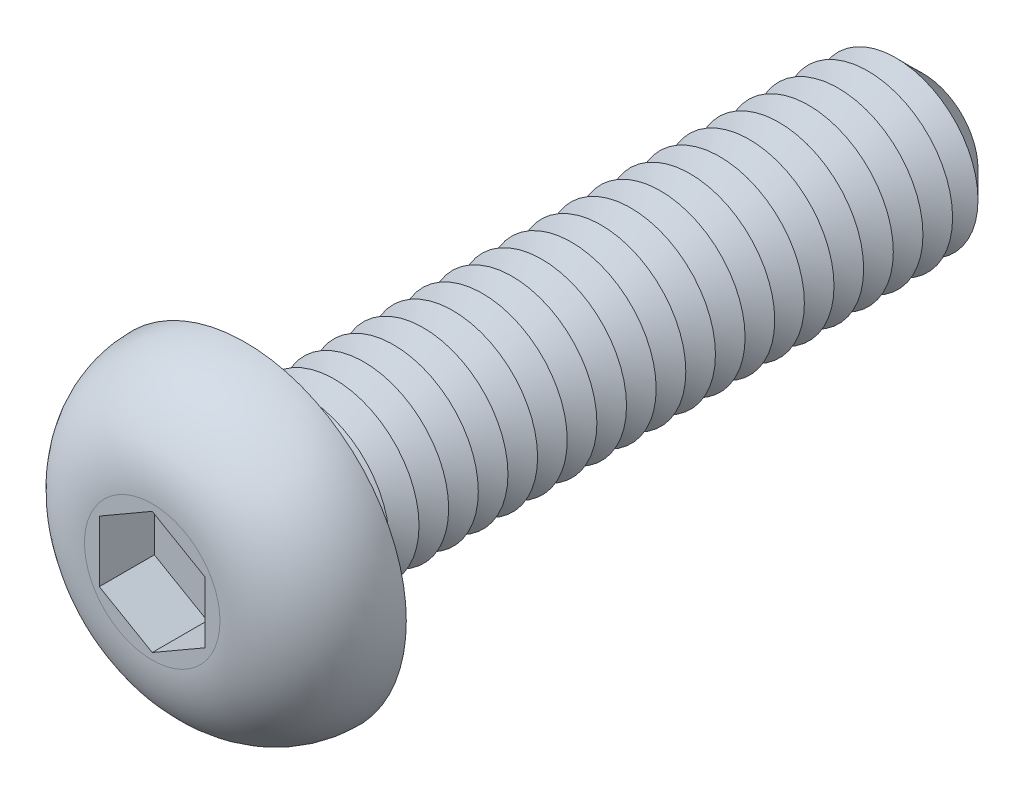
ISO-10303-21;
HEADER;
FILE_DESCRIPTION(('STEP AP214'),'2;1');
FILE_NAME('part.step','',(''),(''),'','','');
FILE_SCHEMA(('AUTOMOTIVE_DESIGN { 1 0 10303 214 1 1 1 1 }'));
ENDSEC;
DATA;
#1=APPLICATION_CONTEXT('core data for automotive mechanical design processes');
#2=APPLICATION_PROTOCOL_DEFINITION('international standard','automotive_design',2000,#1);
#3=PRODUCT_CONTEXT('',#1,'mechanical');
#4=PRODUCT('Part','Part','',(#3));
#5=PRODUCT_RELATED_PRODUCT_CATEGORY('part','',(#4));
#6=PRODUCT_DEFINITION_FORMATION('','',#4);
#7=PRODUCT_DEFINITION_CONTEXT('part definition',#1,'design');
#8=PRODUCT_DEFINITION('design','',#6,#7);
#9=PRODUCT_DEFINITION_SHAPE('','',#8);
#10=(LENGTH_UNIT() NAMED_UNIT(*) SI_UNIT(.MILLI.,.METRE.));
#11=(NAMED_UNIT(*) PLANE_ANGLE_UNIT() SI_UNIT($,.RADIAN.));
#12=(NAMED_UNIT(*) SI_UNIT($,.STERADIAN.) SOLID_ANGLE_UNIT());
#13=UNCERTAINTY_MEASURE_WITH_UNIT(LENGTH_MEASURE(1.E-05),#10,'distance_accuracy_value','');
#14=(GEOMETRIC_REPRESENTATION_CONTEXT(3) GLOBAL_UNCERTAINTY_ASSIGNED_CONTEXT((#13)) GLOBAL_UNIT_ASSIGNED_CONTEXT((#10,
#11,#12)) REPRESENTATION_CONTEXT('',''));
#15=CARTESIAN_POINT('',(0.,0.,0.));
#16=DIRECTION('',(0.,0.,1.));
#17=DIRECTION('',(1.,0.,0.));
#18=AXIS2_PLACEMENT_3D('',#15,#16,#17);
#19=CARTESIAN_POINT('',(0.,0.,-16.));
#20=DIRECTION('',(0.,0.,1.));
#21=DIRECTION('',(1.,0.,0.));
#22=AXIS2_PLACEMENT_3D('',#19,#20,#21);
#23=CYLINDRICAL_SURFACE('',#22,2.);
#24=CARTESIAN_POINT('',(0.,0.,-0.35));
#25=DIRECTION('',(0.,0.,1.));
#26=DIRECTION('',(1.,0.,0.));
#27=AXIS2_PLACEMENT_3D('',#24,#25,#26);
#28=CIRCLE('',#27,2.);
#29=CARTESIAN_POINT('',(2.,0.,-0.35));
#30=VERTEX_POINT('',#29);
#31=EDGE_CURVE('E48',#30,#30,#28,.F.);
#32=ORIENTED_EDGE('',*,*,#31,.T.);
#33=EDGE_LOOP('',(#32));
#34=FACE_BOUND('',#33,.T.);
#35=CARTESIAN_POINT('',(0.,0.,-0.699999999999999));
#36=DIRECTION('',(0.,0.,1.));
#37=DIRECTION('',(1.,0.,0.));
#38=AXIS2_PLACEMENT_3D('',#35,#36,#37);
#39=CIRCLE('',#38,2.);
#40=CARTESIAN_POINT('',(2.,0.,-0.699999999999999));
#41=VERTEX_POINT('',#40);
#42=EDGE_CURVE('E138',#41,#41,#39,.T.);
#43=ORIENTED_EDGE('',*,*,#42,.T.);
#44=EDGE_LOOP('',(#43));
#45=FACE_BOUND('',#44,.T.);
#46=ADVANCED_FACE('F39',(#34,#45),#23,.T.);
#47=CARTESIAN_POINT('',(0.,3.8,0.));
#48=DIRECTION('',(0.,0.,1.));
#49=DIRECTION('',(1.,0.,0.));
#50=AXIS2_PLACEMENT_3D('',#47,#48,#49);
#51=PLANE('',#50);
#52=CARTESIAN_POINT('',(0.,0.,0.));
#53=DIRECTION('',(0.,0.,1.));
#54=DIRECTION('',(1.,0.,0.));
#55=AXIS2_PLACEMENT_3D('',#52,#53,#54);
#56=CIRCLE('',#55,2.35);
#57=CARTESIAN_POINT('',(2.35,0.,0.));
#58=VERTEX_POINT('',#57);
#59=EDGE_CURVE('E11',#58,#58,#56,.T.);
#60=ORIENTED_EDGE('',*,*,#59,.T.);
#61=EDGE_LOOP('',(#60));
#62=FACE_BOUND('',#61,.T.);
#63=CARTESIAN_POINT('',(0.,0.,0.));
#64=DIRECTION('',(0.,0.,1.));
#65=DIRECTION('',(1.,0.,0.));
#66=AXIS2_PLACEMENT_3D('',#63,#64,#65);
#67=CIRCLE('',#66,3.8);
#68=CARTESIAN_POINT('',(3.8,0.,0.));
#69=VERTEX_POINT('',#68);
#70=EDGE_CURVE('E157',#69,#69,#67,.T.);
#71=ORIENTED_EDGE('',*,*,#70,.F.);
#72=EDGE_LOOP('',(#71));
#73=FACE_BOUND('',#72,.T.);
#74=ADVANCED_FACE('F204',(#62,#73),#51,.F.);
#75=CARTESIAN_POINT('',(0.,0.,2.2));
#76=DIRECTION('',(0.,0.,-1.));
#77=DIRECTION('',(-1.,0.,0.));
#78=AXIS2_PLACEMENT_3D('',#75,#76,#77);
#79=PLANE('',#78);
#80=DIRECTION('',(-0.866025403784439,-0.5,0.));
#81=VECTOR('',#80,1.);
#82=CARTESIAN_POINT('',(0.,1.44337567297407,2.2));
#83=LINE('',#82,#81);
#84=CARTESIAN_POINT('',(0.,1.44337567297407,2.2));
#85=VERTEX_POINT('',#84);
#86=CARTESIAN_POINT('',(-1.25,0.721687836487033,2.2));
#87=VERTEX_POINT('',#86);
#88=EDGE_CURVE('E137',#85,#87,#83,.T.);
#89=ORIENTED_EDGE('',*,*,#88,.F.);
#90=DIRECTION('',(-0.866025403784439,0.5,0.));
#91=VECTOR('',#90,1.);
#92=CARTESIAN_POINT('',(1.25,0.721687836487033,2.2));
#93=LINE('',#92,#91);
#94=CARTESIAN_POINT('',(1.25,0.721687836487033,2.2));
#95=VERTEX_POINT('',#94);
#96=EDGE_CURVE('E55',#95,#85,#93,.T.);
#97=ORIENTED_EDGE('',*,*,#96,.F.);
#98=DIRECTION('',(0.,1.,0.));
#99=VECTOR('',#98,1.);
#100=CARTESIAN_POINT('',(1.25,-0.721687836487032,2.2));
#101=LINE('',#100,#99);
#102=CARTESIAN_POINT('',(1.25,-0.721687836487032,2.2));
#103=VERTEX_POINT('',#102);
#104=EDGE_CURVE('E151',#103,#95,#101,.T.);
#105=ORIENTED_EDGE('',*,*,#104,.F.);
#106=DIRECTION('',(0.866025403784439,0.5,0.));
#107=VECTOR('',#106,1.);
#108=CARTESIAN_POINT('',(0.,-1.44337567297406,2.2));
#109=LINE('',#108,#107);
#110=CARTESIAN_POINT('',(0.,-1.44337567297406,2.2));
#111=VERTEX_POINT('',#110);
#112=EDGE_CURVE('E148',#111,#103,#109,.T.);
#113=ORIENTED_EDGE('',*,*,#112,.F.);
#114=DIRECTION('',(0.866025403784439,-0.5,0.));
#115=VECTOR('',#114,1.);
#116=CARTESIAN_POINT('',(-1.25,-0.721687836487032,2.2));
#117=LINE('',#116,#115);
#118=CARTESIAN_POINT('',(-1.25,-0.721687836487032,2.2));
#119=VERTEX_POINT('',#118);
#120=EDGE_CURVE('E103',#119,#111,#117,.T.);
#121=ORIENTED_EDGE('',*,*,#120,.F.);
#122=DIRECTION('',(0.,-1.,0.));
#123=VECTOR('',#122,1.);
#124=CARTESIAN_POINT('',(-1.25,0.721687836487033,2.2));
#125=LINE('',#124,#123);
#126=EDGE_CURVE('E142',#87,#119,#125,.T.);
#127=ORIENTED_EDGE('',*,*,#126,.F.);
#128=EDGE_LOOP('',(#89,#97,#105,#113,#121,#127));
#129=FACE_BOUND('',#128,.T.);
#130=CARTESIAN_POINT('',(0.,0.,2.2));
#131=DIRECTION('',(0.,0.,1.));
#132=DIRECTION('',(1.,0.,0.));
#133=AXIS2_PLACEMENT_3D('',#130,#131,#132);
#134=CIRCLE('',#133,1.6);
#135=CARTESIAN_POINT('',(1.6,0.,2.2));
#136=VERTEX_POINT('',#135);
#137=EDGE_CURVE('E170',#136,#136,#134,.T.);
#138=ORIENTED_EDGE('',*,*,#137,.T.);
#139=EDGE_LOOP('',(#138));
#140=FACE_BOUND('',#139,.T.);
#141=ADVANCED_FACE('F209',(#129,#140),#79,.F.);
#142=CARTESIAN_POINT('',(0.,0.,0.));
#143=DIRECTION('',(0.,0.,1.));
#144=DIRECTION('',(1.,0.,0.));
#145=AXIS2_PLACEMENT_3D('',#142,#143,#144);
#146=DEGENERATE_TOROIDAL_SURFACE('',#145,1.6,2.2,.T.);
#147=ORIENTED_EDGE('',*,*,#137,.F.);
#148=EDGE_LOOP('',(#147));
#149=FACE_BOUND('',#148,.T.);
#150=ORIENTED_EDGE('',*,*,#70,.T.);
#151=EDGE_LOOP('',(#150));
#152=FACE_BOUND('',#151,.T.);
#153=ADVANCED_FACE('F237',(#149,#152),#146,.T.);
#154=CARTESIAN_POINT('',(1.25,0.721687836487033,0.9));
#155=DIRECTION('',(0.5,0.866025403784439,0.));
#156=DIRECTION('',(-0.866025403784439,0.5,0.));
#157=AXIS2_PLACEMENT_3D('',#154,#155,#156);
#158=PLANE('',#157);
#159=ORIENTED_EDGE('',*,*,#96,.T.);
#160=DIRECTION('',(0.,0.,1.));
#161=VECTOR('',#160,1.);
#162=CARTESIAN_POINT('',(0.,1.44337567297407,0.9));
#163=LINE('',#162,#161);
#164=CARTESIAN_POINT('',(0.,1.44337567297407,0.9));
#165=VERTEX_POINT('',#164);
#166=EDGE_CURVE('E85',#165,#85,#163,.T.);
#167=ORIENTED_EDGE('',*,*,#166,.F.);
#168=DIRECTION('',(-0.866025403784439,0.5,0.));
#169=VECTOR('',#168,1.);
#170=CARTESIAN_POINT('',(1.25,0.721687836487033,0.9));
#171=LINE('',#170,#169);
#172=CARTESIAN_POINT('',(1.25,0.721687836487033,0.9));
#173=VERTEX_POINT('',#172);
#174=EDGE_CURVE('E154',#173,#165,#171,.T.);
#175=ORIENTED_EDGE('',*,*,#174,.F.);
#176=DIRECTION('',(0.,0.,1.));
#177=VECTOR('',#176,1.);
#178=CARTESIAN_POINT('',(1.25,0.721687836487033,0.9));
#179=LINE('',#178,#177);
#180=EDGE_CURVE('E63',#173,#95,#179,.T.);
#181=ORIENTED_EDGE('',*,*,#180,.T.);
#182=EDGE_LOOP('',(#159,#167,#175,#181));
#183=FACE_BOUND('',#182,.T.);
#184=ADVANCED_FACE('F223',(#183),#158,.F.);
#185=CARTESIAN_POINT('',(1.25,-0.721687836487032,0.9));
#186=DIRECTION('',(1.,0.,0.));
#187=DIRECTION('',(0.,1.,0.));
#188=AXIS2_PLACEMENT_3D('',#185,#186,#187);
#189=PLANE('',#188);
#190=ORIENTED_EDGE('',*,*,#104,.T.);
#191=ORIENTED_EDGE('',*,*,#180,.F.);
#192=DIRECTION('',(0.,1.,0.));
#193=VECTOR('',#192,1.);
#194=CARTESIAN_POINT('',(1.25,-0.721687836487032,0.9));
#195=LINE('',#194,#193);
#196=CARTESIAN_POINT('',(1.25,-0.721687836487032,0.9));
#197=VERTEX_POINT('',#196);
#198=EDGE_CURVE('E117',#197,#173,#195,.T.);
#199=ORIENTED_EDGE('',*,*,#198,.F.);
#200=DIRECTION('',(0.,0.,1.));
#201=VECTOR('',#200,1.);
#202=CARTESIAN_POINT('',(1.25,-0.721687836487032,0.9));
#203=LINE('',#202,#201);
#204=EDGE_CURVE('E108',#197,#103,#203,.T.);
#205=ORIENTED_EDGE('',*,*,#204,.T.);
#206=EDGE_LOOP('',(#190,#191,#199,#205));
#207=FACE_BOUND('',#206,.T.);
#208=ADVANCED_FACE('F220',(#207),#189,.F.);
#209=CARTESIAN_POINT('',(0.,-1.44337567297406,0.9));
#210=DIRECTION('',(0.5,-0.866025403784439,0.));
#211=DIRECTION('',(0.866025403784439,0.5,0.));
#212=AXIS2_PLACEMENT_3D('',#209,#210,#211);
#213=PLANE('',#212);
#214=ORIENTED_EDGE('',*,*,#112,.T.);
#215=ORIENTED_EDGE('',*,*,#204,.F.);
#216=DIRECTION('',(0.866025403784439,0.5,0.));
#217=VECTOR('',#216,1.);
#218=CARTESIAN_POINT('',(0.,-1.44337567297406,0.9));
#219=LINE('',#218,#217);
#220=CARTESIAN_POINT('',(0.,-1.44337567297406,0.9));
#221=VERTEX_POINT('',#220);
#222=EDGE_CURVE('E112',#221,#197,#219,.T.);
#223=ORIENTED_EDGE('',*,*,#222,.F.);
#224=DIRECTION('',(0.,0.,1.));
#225=VECTOR('',#224,1.);
#226=CARTESIAN_POINT('',(0.,-1.44337567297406,0.9));
#227=LINE('',#226,#225);
#228=EDGE_CURVE('E96',#221,#111,#227,.T.);
#229=ORIENTED_EDGE('',*,*,#228,.T.);
#230=EDGE_LOOP('',(#214,#215,#223,#229));
#231=FACE_BOUND('',#230,.T.);
#232=ADVANCED_FACE('F113',(#231),#213,.F.);
#233=CARTESIAN_POINT('',(-1.25,-0.721687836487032,0.9));
#234=DIRECTION('',(-0.5,-0.866025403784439,0.));
#235=DIRECTION('',(0.866025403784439,-0.5,0.));
#236=AXIS2_PLACEMENT_3D('',#233,#234,#235);
#237=PLANE('',#236);
#238=ORIENTED_EDGE('',*,*,#120,.T.);
#239=ORIENTED_EDGE('',*,*,#228,.F.);
#240=DIRECTION('',(0.866025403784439,-0.5,0.));
#241=VECTOR('',#240,1.);
#242=CARTESIAN_POINT('',(-1.25,-0.721687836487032,0.9));
#243=LINE('',#242,#241);
#244=CARTESIAN_POINT('',(-1.25,-0.721687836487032,0.9));
#245=VERTEX_POINT('',#244);
#246=EDGE_CURVE('E100',#245,#221,#243,.T.);
#247=ORIENTED_EDGE('',*,*,#246,.F.);
#248=DIRECTION('',(0.,0.,1.));
#249=VECTOR('',#248,1.);
#250=CARTESIAN_POINT('',(-1.25,-0.721687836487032,0.9));
#251=LINE('',#250,#249);
#252=EDGE_CURVE('E109',#245,#119,#251,.T.);
#253=ORIENTED_EDGE('',*,*,#252,.T.);
#254=EDGE_LOOP('',(#238,#239,#247,#253));
#255=FACE_BOUND('',#254,.T.);
#256=ADVANCED_FACE('F98',(#255),#237,.F.);
#257=CARTESIAN_POINT('',(-1.25,0.721687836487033,0.9));
#258=DIRECTION('',(-1.,0.,0.));
#259=DIRECTION('',(0.,-1.,0.));
#260=AXIS2_PLACEMENT_3D('',#257,#258,#259);
#261=PLANE('',#260);
#262=ORIENTED_EDGE('',*,*,#126,.T.);
#263=ORIENTED_EDGE('',*,*,#252,.F.);
#264=DIRECTION('',(0.,-1.,0.));
#265=VECTOR('',#264,1.);
#266=CARTESIAN_POINT('',(-1.25,0.721687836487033,0.9));
#267=LINE('',#266,#265);
#268=CARTESIAN_POINT('',(-1.25,0.721687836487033,0.9));
#269=VERTEX_POINT('',#268);
#270=EDGE_CURVE('E123',#269,#245,#267,.T.);
#271=ORIENTED_EDGE('',*,*,#270,.F.);
#272=DIRECTION('',(0.,0.,1.));
#273=VECTOR('',#272,1.);
#274=CARTESIAN_POINT('',(-1.25,0.721687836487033,0.9));
#275=LINE('',#274,#273);
#276=EDGE_CURVE('E162',#269,#87,#275,.T.);
#277=ORIENTED_EDGE('',*,*,#276,.T.);
#278=EDGE_LOOP('',(#262,#263,#271,#277));
#279=FACE_BOUND('',#278,.T.);
#280=ADVANCED_FACE('F228',(#279),#261,.F.);
#281=CARTESIAN_POINT('',(0.,1.44337567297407,0.9));
#282=DIRECTION('',(-0.5,0.866025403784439,0.));
#283=DIRECTION('',(-0.866025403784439,-0.5,0.));
#284=AXIS2_PLACEMENT_3D('',#281,#282,#283);
#285=PLANE('',#284);
#286=ORIENTED_EDGE('',*,*,#88,.T.);
#287=ORIENTED_EDGE('',*,*,#276,.F.);
#288=DIRECTION('',(-0.866025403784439,-0.5,0.));
#289=VECTOR('',#288,1.);
#290=CARTESIAN_POINT('',(0.,1.44337567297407,0.9));
#291=LINE('',#290,#289);
#292=EDGE_CURVE('E129',#165,#269,#291,.T.);
#293=ORIENTED_EDGE('',*,*,#292,.F.);
#294=ORIENTED_EDGE('',*,*,#166,.T.);
#295=EDGE_LOOP('',(#286,#287,#293,#294));
#296=FACE_BOUND('',#295,.T.);
#297=ADVANCED_FACE('F218',(#296),#285,.F.);
#298=CARTESIAN_POINT('',(0.,0.,0.9));
#299=DIRECTION('',(0.,0.,1.));
#300=DIRECTION('',(1.,0.,0.));
#301=AXIS2_PLACEMENT_3D('',#298,#299,#300);
#302=PLANE('',#301);
#303=CARTESIAN_POINT('',(0.,0.,0.9));
#304=DIRECTION('',(0.,0.,1.));
#305=DIRECTION('',(1.,0.,0.));
#306=AXIS2_PLACEMENT_3D('',#303,#304,#305);
#307=CIRCLE('',#306,0.5);
#308=CARTESIAN_POINT('',(0.5,0.,0.9));
#309=VERTEX_POINT('',#308);
#310=EDGE_CURVE('E423',#309,#309,#307,.T.);
#311=ORIENTED_EDGE('',*,*,#310,.F.);
#312=EDGE_LOOP('',(#311));
#313=FACE_BOUND('',#312,.T.);
#314=ORIENTED_EDGE('',*,*,#174,.T.);
#315=ORIENTED_EDGE('',*,*,#292,.T.);
#316=ORIENTED_EDGE('',*,*,#270,.T.);
#317=ORIENTED_EDGE('',*,*,#246,.T.);
#318=ORIENTED_EDGE('',*,*,#222,.T.);
#319=ORIENTED_EDGE('',*,*,#198,.T.);
#320=EDGE_LOOP('',(#314,#315,#316,#317,#318,#319));
#321=FACE_BOUND('',#320,.T.);
#322=ADVANCED_FACE('F120',(#313,#321),#302,.T.);
#323=CARTESIAN_POINT('',(0.,0.,-0.699999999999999));
#324=DIRECTION('',(0.,0.,1.));
#325=DIRECTION('',(1.,0.,0.));
#326=AXIS2_PLACEMENT_3D('',#323,#324,#325);
#327=CONICAL_SURFACE('',#326,2.,1.04719755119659);
#328=CARTESIAN_POINT('',(0.,0.,-1.05));
#329=DIRECTION('',(0.,0.,1.));
#330=DIRECTION('',(1.,0.,0.));
#331=AXIS2_PLACEMENT_3D('',#328,#329,#330);
#332=CIRCLE('',#331,1.39378221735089);
#333=CARTESIAN_POINT('',(1.39378221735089,0.,-1.05));
#334=VERTEX_POINT('',#333);
#335=EDGE_CURVE('E261',#334,#334,#332,.T.);
#336=ORIENTED_EDGE('',*,*,#335,.T.);
#337=EDGE_LOOP('',(#336));
#338=FACE_BOUND('',#337,.T.);
#339=ORIENTED_EDGE('',*,*,#42,.F.);
#340=EDGE_LOOP('',(#339));
#341=FACE_BOUND('',#340,.T.);
#342=ADVANCED_FACE('F217',(#338,#341),#327,.T.);
#343=CARTESIAN_POINT('',(0.,0.,-1.05));
#344=DIRECTION('',(0.,0.,-1.));
#345=DIRECTION('',(-1.,0.,0.));
#346=AXIS2_PLACEMENT_3D('',#343,#344,#345);
#347=CONICAL_SURFACE('',#346,1.39378221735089,1.0471975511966);
#348=CARTESIAN_POINT('',(0.,0.,-1.4));
#349=DIRECTION('',(0.,0.,1.));
#350=DIRECTION('',(1.,0.,0.));
#351=AXIS2_PLACEMENT_3D('',#348,#349,#350);
#352=CIRCLE('',#351,2.);
#353=CARTESIAN_POINT('',(2.,0.,-1.4));
#354=VERTEX_POINT('',#353);
#355=EDGE_CURVE('E265',#354,#354,#352,.T.);
#356=ORIENTED_EDGE('',*,*,#355,.T.);
#357=EDGE_LOOP('',(#356));
#358=FACE_BOUND('',#357,.T.);
#359=ORIENTED_EDGE('',*,*,#335,.F.);
#360=EDGE_LOOP('',(#359));
#361=FACE_BOUND('',#360,.T.);
#362=ADVANCED_FACE('F673',(#358,#361),#347,.T.);
#363=CARTESIAN_POINT('',(0.,0.,-1.4));
#364=DIRECTION('',(0.,0.,1.));
#365=DIRECTION('',(1.,0.,0.));
#366=AXIS2_PLACEMENT_3D('',#363,#364,#365);
#367=CONICAL_SURFACE('',#366,2.,1.04719755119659);
#368=CARTESIAN_POINT('',(0.,0.,-1.75));
#369=DIRECTION('',(0.,0.,1.));
#370=DIRECTION('',(1.,0.,0.));
#371=AXIS2_PLACEMENT_3D('',#368,#369,#370);
#372=CIRCLE('',#371,1.39378221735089);
#373=CARTESIAN_POINT('',(1.39378221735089,0.,-1.75));
#374=VERTEX_POINT('',#373);
#375=EDGE_CURVE('E269',#374,#374,#372,.T.);
#376=ORIENTED_EDGE('',*,*,#375,.T.);
#377=EDGE_LOOP('',(#376));
#378=FACE_BOUND('',#377,.T.);
#379=ORIENTED_EDGE('',*,*,#355,.F.);
#380=EDGE_LOOP('',(#379));
#381=FACE_BOUND('',#380,.T.);
#382=ADVANCED_FACE('F667',(#378,#381),#367,.T.);
#383=CARTESIAN_POINT('',(0.,0.,-1.75));
#384=DIRECTION('',(0.,0.,-1.));
#385=DIRECTION('',(-1.,0.,0.));
#386=AXIS2_PLACEMENT_3D('',#383,#384,#385);
#387=CONICAL_SURFACE('',#386,1.39378221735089,1.0471975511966);
#388=CARTESIAN_POINT('',(0.,0.,-2.1));
#389=DIRECTION('',(0.,0.,1.));
#390=DIRECTION('',(1.,0.,0.));
#391=AXIS2_PLACEMENT_3D('',#388,#389,#390);
#392=CIRCLE('',#391,2.);
#393=CARTESIAN_POINT('',(2.,0.,-2.1));
#394=VERTEX_POINT('',#393);
#395=EDGE_CURVE('E273',#394,#394,#392,.T.);
#396=ORIENTED_EDGE('',*,*,#395,.T.);
#397=EDGE_LOOP('',(#396));
#398=FACE_BOUND('',#397,.T.);
#399=ORIENTED_EDGE('',*,*,#375,.F.);
#400=EDGE_LOOP('',(#399));
#401=FACE_BOUND('',#400,.T.);
#402=ADVANCED_FACE('F661',(#398,#401),#387,.T.);
#403=CARTESIAN_POINT('',(0.,0.,-2.1));
#404=DIRECTION('',(0.,0.,1.));
#405=DIRECTION('',(1.,0.,0.));
#406=AXIS2_PLACEMENT_3D('',#403,#404,#405);
#407=CONICAL_SURFACE('',#406,2.,1.04719755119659);
#408=CARTESIAN_POINT('',(0.,0.,-2.45));
#409=DIRECTION('',(0.,0.,1.));
#410=DIRECTION('',(1.,0.,0.));
#411=AXIS2_PLACEMENT_3D('',#408,#409,#410);
#412=CIRCLE('',#411,1.39378221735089);
#413=CARTESIAN_POINT('',(1.39378221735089,0.,-2.45));
#414=VERTEX_POINT('',#413);
#415=EDGE_CURVE('E277',#414,#414,#412,.T.);
#416=ORIENTED_EDGE('',*,*,#415,.T.);
#417=EDGE_LOOP('',(#416));
#418=FACE_BOUND('',#417,.T.);
#419=ORIENTED_EDGE('',*,*,#395,.F.);
#420=EDGE_LOOP('',(#419));
#421=FACE_BOUND('',#420,.T.);
#422=ADVANCED_FACE('F655',(#418,#421),#407,.T.);
#423=CARTESIAN_POINT('',(0.,0.,-2.45));
#424=DIRECTION('',(0.,0.,-1.));
#425=DIRECTION('',(-1.,0.,0.));
#426=AXIS2_PLACEMENT_3D('',#423,#424,#425);
#427=CONICAL_SURFACE('',#426,1.39378221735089,1.0471975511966);
#428=CARTESIAN_POINT('',(0.,0.,-2.8));
#429=DIRECTION('',(0.,0.,1.));
#430=DIRECTION('',(1.,0.,0.));
#431=AXIS2_PLACEMENT_3D('',#428,#429,#430);
#432=CIRCLE('',#431,2.);
#433=CARTESIAN_POINT('',(2.,0.,-2.8));
#434=VERTEX_POINT('',#433);
#435=EDGE_CURVE('E281',#434,#434,#432,.T.);
#436=ORIENTED_EDGE('',*,*,#435,.T.);
#437=EDGE_LOOP('',(#436));
#438=FACE_BOUND('',#437,.T.);
#439=ORIENTED_EDGE('',*,*,#415,.F.);
#440=EDGE_LOOP('',(#439));
#441=FACE_BOUND('',#440,.T.);
#442=ADVANCED_FACE('F649',(#438,#441),#427,.T.);
#443=CARTESIAN_POINT('',(0.,0.,-2.8));
#444=DIRECTION('',(0.,0.,1.));
#445=DIRECTION('',(1.,0.,0.));
#446=AXIS2_PLACEMENT_3D('',#443,#444,#445);
#447=CONICAL_SURFACE('',#446,2.,1.04719755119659);
#448=CARTESIAN_POINT('',(0.,0.,-3.15));
#449=DIRECTION('',(0.,0.,1.));
#450=DIRECTION('',(1.,0.,0.));
#451=AXIS2_PLACEMENT_3D('',#448,#449,#450);
#452=CIRCLE('',#451,1.39378221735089);
#453=CARTESIAN_POINT('',(1.39378221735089,0.,-3.15));
#454=VERTEX_POINT('',#453);
#455=EDGE_CURVE('E285',#454,#454,#452,.T.);
#456=ORIENTED_EDGE('',*,*,#455,.T.);
#457=EDGE_LOOP('',(#456));
#458=FACE_BOUND('',#457,.T.);
#459=ORIENTED_EDGE('',*,*,#435,.F.);
#460=EDGE_LOOP('',(#459));
#461=FACE_BOUND('',#460,.T.);
#462=ADVANCED_FACE('F643',(#458,#461),#447,.T.);
#463=CARTESIAN_POINT('',(0.,0.,-3.15));
#464=DIRECTION('',(0.,0.,-1.));
#465=DIRECTION('',(-1.,0.,0.));
#466=AXIS2_PLACEMENT_3D('',#463,#464,#465);
#467=CONICAL_SURFACE('',#466,1.39378221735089,1.0471975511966);
#468=CARTESIAN_POINT('',(0.,0.,-3.5));
#469=DIRECTION('',(0.,0.,1.));
#470=DIRECTION('',(1.,0.,0.));
#471=AXIS2_PLACEMENT_3D('',#468,#469,#470);
#472=CIRCLE('',#471,2.);
#473=CARTESIAN_POINT('',(2.,0.,-3.5));
#474=VERTEX_POINT('',#473);
#475=EDGE_CURVE('E288',#474,#474,#472,.T.);
#476=ORIENTED_EDGE('',*,*,#475,.T.);
#477=EDGE_LOOP('',(#476));
#478=FACE_BOUND('',#477,.T.);
#479=ORIENTED_EDGE('',*,*,#455,.F.);
#480=EDGE_LOOP('',(#479));
#481=FACE_BOUND('',#480,.T.);
#482=ADVANCED_FACE('F637',(#478,#481),#467,.T.);
#483=CARTESIAN_POINT('',(0.,0.,-3.5));
#484=DIRECTION('',(0.,0.,1.));
#485=DIRECTION('',(1.,0.,0.));
#486=AXIS2_PLACEMENT_3D('',#483,#484,#485);
#487=CONICAL_SURFACE('',#486,2.,1.04719755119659);
#488=CARTESIAN_POINT('',(0.,0.,-3.85));
#489=DIRECTION('',(0.,0.,1.));
#490=DIRECTION('',(1.,0.,0.));
#491=AXIS2_PLACEMENT_3D('',#488,#489,#490);
#492=CIRCLE('',#491,1.39378221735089);
#493=CARTESIAN_POINT('',(1.39378221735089,0.,-3.85));
#494=VERTEX_POINT('',#493);
#495=EDGE_CURVE('E292',#494,#494,#492,.T.);
#496=ORIENTED_EDGE('',*,*,#495,.T.);
#497=EDGE_LOOP('',(#496));
#498=FACE_BOUND('',#497,.T.);
#499=ORIENTED_EDGE('',*,*,#475,.F.);
#500=EDGE_LOOP('',(#499));
#501=FACE_BOUND('',#500,.T.);
#502=ADVANCED_FACE('F631',(#498,#501),#487,.T.);
#503=CARTESIAN_POINT('',(0.,0.,-3.85));
#504=DIRECTION('',(0.,0.,-1.));
#505=DIRECTION('',(-1.,0.,0.));
#506=AXIS2_PLACEMENT_3D('',#503,#504,#505);
#507=CONICAL_SURFACE('',#506,1.39378221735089,1.0471975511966);
#508=CARTESIAN_POINT('',(0.,0.,-4.2));
#509=DIRECTION('',(0.,0.,1.));
#510=DIRECTION('',(1.,0.,0.));
#511=AXIS2_PLACEMENT_3D('',#508,#509,#510);
#512=CIRCLE('',#511,2.);
#513=CARTESIAN_POINT('',(2.,0.,-4.2));
#514=VERTEX_POINT('',#513);
#515=EDGE_CURVE('E296',#514,#514,#512,.T.);
#516=ORIENTED_EDGE('',*,*,#515,.T.);
#517=EDGE_LOOP('',(#516));
#518=FACE_BOUND('',#517,.T.);
#519=ORIENTED_EDGE('',*,*,#495,.F.);
#520=EDGE_LOOP('',(#519));
#521=FACE_BOUND('',#520,.T.);
#522=ADVANCED_FACE('F625',(#518,#521),#507,.T.);
#523=CARTESIAN_POINT('',(0.,0.,-4.2));
#524=DIRECTION('',(0.,0.,1.));
#525=DIRECTION('',(1.,0.,0.));
#526=AXIS2_PLACEMENT_3D('',#523,#524,#525);
#527=CONICAL_SURFACE('',#526,2.,1.04719755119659);
#528=CARTESIAN_POINT('',(0.,0.,-4.55));
#529=DIRECTION('',(0.,0.,1.));
#530=DIRECTION('',(1.,0.,0.));
#531=AXIS2_PLACEMENT_3D('',#528,#529,#530);
#532=CIRCLE('',#531,1.39378221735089);
#533=CARTESIAN_POINT('',(1.39378221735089,0.,-4.55));
#534=VERTEX_POINT('',#533);
#535=EDGE_CURVE('E300',#534,#534,#532,.T.);
#536=ORIENTED_EDGE('',*,*,#535,.T.);
#537=EDGE_LOOP('',(#536));
#538=FACE_BOUND('',#537,.T.);
#539=ORIENTED_EDGE('',*,*,#515,.F.);
#540=EDGE_LOOP('',(#539));
#541=FACE_BOUND('',#540,.T.);
#542=ADVANCED_FACE('F619',(#538,#541),#527,.T.);
#543=CARTESIAN_POINT('',(0.,0.,-4.55));
#544=DIRECTION('',(0.,0.,-1.));
#545=DIRECTION('',(-1.,0.,0.));
#546=AXIS2_PLACEMENT_3D('',#543,#544,#545);
#547=CONICAL_SURFACE('',#546,1.39378221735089,1.0471975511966);
#548=CARTESIAN_POINT('',(0.,0.,-4.9));
#549=DIRECTION('',(0.,0.,1.));
#550=DIRECTION('',(1.,0.,0.));
#551=AXIS2_PLACEMENT_3D('',#548,#549,#550);
#552=CIRCLE('',#551,2.);
#553=CARTESIAN_POINT('',(2.,0.,-4.9));
#554=VERTEX_POINT('',#553);
#555=EDGE_CURVE('E304',#554,#554,#552,.T.);
#556=ORIENTED_EDGE('',*,*,#555,.T.);
#557=EDGE_LOOP('',(#556));
#558=FACE_BOUND('',#557,.T.);
#559=ORIENTED_EDGE('',*,*,#535,.F.);
#560=EDGE_LOOP('',(#559));
#561=FACE_BOUND('',#560,.T.);
#562=ADVANCED_FACE('F613',(#558,#561),#547,.T.);
#563=CARTESIAN_POINT('',(0.,0.,-4.9));
#564=DIRECTION('',(0.,0.,1.));
#565=DIRECTION('',(1.,0.,0.));
#566=AXIS2_PLACEMENT_3D('',#563,#564,#565);
#567=CONICAL_SURFACE('',#566,2.,1.04719755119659);
#568=CARTESIAN_POINT('',(0.,0.,-5.25));
#569=DIRECTION('',(0.,0.,1.));
#570=DIRECTION('',(1.,0.,0.));
#571=AXIS2_PLACEMENT_3D('',#568,#569,#570);
#572=CIRCLE('',#571,1.39378221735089);
#573=CARTESIAN_POINT('',(1.39378221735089,0.,-5.25));
#574=VERTEX_POINT('',#573);
#575=EDGE_CURVE('E308',#574,#574,#572,.T.);
#576=ORIENTED_EDGE('',*,*,#575,.T.);
#577=EDGE_LOOP('',(#576));
#578=FACE_BOUND('',#577,.T.);
#579=ORIENTED_EDGE('',*,*,#555,.F.);
#580=EDGE_LOOP('',(#579));
#581=FACE_BOUND('',#580,.T.);
#582=ADVANCED_FACE('F607',(#578,#581),#567,.T.);
#583=CARTESIAN_POINT('',(0.,0.,-5.25));
#584=DIRECTION('',(0.,0.,-1.));
#585=DIRECTION('',(-1.,0.,0.));
#586=AXIS2_PLACEMENT_3D('',#583,#584,#585);
#587=CONICAL_SURFACE('',#586,1.39378221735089,1.0471975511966);
#588=CARTESIAN_POINT('',(0.,0.,-5.6));
#589=DIRECTION('',(0.,0.,1.));
#590=DIRECTION('',(1.,0.,0.));
#591=AXIS2_PLACEMENT_3D('',#588,#589,#590);
#592=CIRCLE('',#591,2.);
#593=CARTESIAN_POINT('',(2.,0.,-5.6));
#594=VERTEX_POINT('',#593);
#595=EDGE_CURVE('E312',#594,#594,#592,.T.);
#596=ORIENTED_EDGE('',*,*,#595,.T.);
#597=EDGE_LOOP('',(#596));
#598=FACE_BOUND('',#597,.T.);
#599=ORIENTED_EDGE('',*,*,#575,.F.);
#600=EDGE_LOOP('',(#599));
#601=FACE_BOUND('',#600,.T.);
#602=ADVANCED_FACE('F601',(#598,#601),#587,.T.);
#603=CARTESIAN_POINT('',(0.,0.,-5.6));
#604=DIRECTION('',(0.,0.,1.));
#605=DIRECTION('',(1.,0.,0.));
#606=AXIS2_PLACEMENT_3D('',#603,#604,#605);
#607=CONICAL_SURFACE('',#606,2.,1.04719755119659);
#608=CARTESIAN_POINT('',(0.,0.,-5.95));
#609=DIRECTION('',(0.,0.,1.));
#610=DIRECTION('',(1.,0.,0.));
#611=AXIS2_PLACEMENT_3D('',#608,#609,#610);
#612=CIRCLE('',#611,1.39378221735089);
#613=CARTESIAN_POINT('',(1.39378221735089,0.,-5.95));
#614=VERTEX_POINT('',#613);
#615=EDGE_CURVE('E316',#614,#614,#612,.T.);
#616=ORIENTED_EDGE('',*,*,#615,.T.);
#617=EDGE_LOOP('',(#616));
#618=FACE_BOUND('',#617,.T.);
#619=ORIENTED_EDGE('',*,*,#595,.F.);
#620=EDGE_LOOP('',(#619));
#621=FACE_BOUND('',#620,.T.);
#622=ADVANCED_FACE('F595',(#618,#621),#607,.T.);
#623=CARTESIAN_POINT('',(0.,0.,-5.95));
#624=DIRECTION('',(0.,0.,-1.));
#625=DIRECTION('',(-1.,0.,0.));
#626=AXIS2_PLACEMENT_3D('',#623,#624,#625);
#627=CONICAL_SURFACE('',#626,1.39378221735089,1.0471975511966);
#628=CARTESIAN_POINT('',(0.,0.,-6.3));
#629=DIRECTION('',(0.,0.,1.));
#630=DIRECTION('',(1.,0.,0.));
#631=AXIS2_PLACEMENT_3D('',#628,#629,#630);
#632=CIRCLE('',#631,2.);
#633=CARTESIAN_POINT('',(2.,0.,-6.3));
#634=VERTEX_POINT('',#633);
#635=EDGE_CURVE('E319',#634,#634,#632,.T.);
#636=ORIENTED_EDGE('',*,*,#635,.T.);
#637=EDGE_LOOP('',(#636));
#638=FACE_BOUND('',#637,.T.);
#639=ORIENTED_EDGE('',*,*,#615,.F.);
#640=EDGE_LOOP('',(#639));
#641=FACE_BOUND('',#640,.T.);
#642=ADVANCED_FACE('F589',(#638,#641),#627,.T.);
#643=CARTESIAN_POINT('',(0.,0.,-6.3));
#644=DIRECTION('',(0.,0.,1.));
#645=DIRECTION('',(1.,0.,0.));
#646=AXIS2_PLACEMENT_3D('',#643,#644,#645);
#647=CONICAL_SURFACE('',#646,2.,1.04719755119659);
#648=CARTESIAN_POINT('',(0.,0.,-6.65));
#649=DIRECTION('',(0.,0.,1.));
#650=DIRECTION('',(1.,0.,0.));
#651=AXIS2_PLACEMENT_3D('',#648,#649,#650);
#652=CIRCLE('',#651,1.39378221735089);
#653=CARTESIAN_POINT('',(1.39378221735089,0.,-6.65));
#654=VERTEX_POINT('',#653);
#655=EDGE_CURVE('E323',#654,#654,#652,.T.);
#656=ORIENTED_EDGE('',*,*,#655,.T.);
#657=EDGE_LOOP('',(#656));
#658=FACE_BOUND('',#657,.T.);
#659=ORIENTED_EDGE('',*,*,#635,.F.);
#660=EDGE_LOOP('',(#659));
#661=FACE_BOUND('',#660,.T.);
#662=ADVANCED_FACE('F583',(#658,#661),#647,.T.);
#663=CARTESIAN_POINT('',(0.,0.,-6.65));
#664=DIRECTION('',(0.,0.,-1.));
#665=DIRECTION('',(-1.,0.,0.));
#666=AXIS2_PLACEMENT_3D('',#663,#664,#665);
#667=CONICAL_SURFACE('',#666,1.39378221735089,1.0471975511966);
#668=CARTESIAN_POINT('',(0.,0.,-7.));
#669=DIRECTION('',(0.,0.,1.));
#670=DIRECTION('',(1.,0.,0.));
#671=AXIS2_PLACEMENT_3D('',#668,#669,#670);
#672=CIRCLE('',#671,2.);
#673=CARTESIAN_POINT('',(2.,0.,-7.));
#674=VERTEX_POINT('',#673);
#675=EDGE_CURVE('E327',#674,#674,#672,.T.);
#676=ORIENTED_EDGE('',*,*,#675,.T.);
#677=EDGE_LOOP('',(#676));
#678=FACE_BOUND('',#677,.T.);
#679=ORIENTED_EDGE('',*,*,#655,.F.);
#680=EDGE_LOOP('',(#679));
#681=FACE_BOUND('',#680,.T.);
#682=ADVANCED_FACE('F577',(#678,#681),#667,.T.);
#683=CARTESIAN_POINT('',(0.,0.,-7.));
#684=DIRECTION('',(0.,0.,1.));
#685=DIRECTION('',(1.,0.,0.));
#686=AXIS2_PLACEMENT_3D('',#683,#684,#685);
#687=CONICAL_SURFACE('',#686,2.,1.04719755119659);
#688=CARTESIAN_POINT('',(0.,0.,-7.35));
#689=DIRECTION('',(0.,0.,1.));
#690=DIRECTION('',(1.,0.,0.));
#691=AXIS2_PLACEMENT_3D('',#688,#689,#690);
#692=CIRCLE('',#691,1.39378221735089);
#693=CARTESIAN_POINT('',(1.39378221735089,0.,-7.35));
#694=VERTEX_POINT('',#693);
#695=EDGE_CURVE('E331',#694,#694,#692,.T.);
#696=ORIENTED_EDGE('',*,*,#695,.T.);
#697=EDGE_LOOP('',(#696));
#698=FACE_BOUND('',#697,.T.);
#699=ORIENTED_EDGE('',*,*,#675,.F.);
#700=EDGE_LOOP('',(#699));
#701=FACE_BOUND('',#700,.T.);
#702=ADVANCED_FACE('F571',(#698,#701),#687,.T.);
#703=CARTESIAN_POINT('',(0.,0.,-7.35));
#704=DIRECTION('',(0.,0.,-1.));
#705=DIRECTION('',(-1.,0.,0.));
#706=AXIS2_PLACEMENT_3D('',#703,#704,#705);
#707=CONICAL_SURFACE('',#706,1.39378221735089,1.0471975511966);
#708=CARTESIAN_POINT('',(0.,0.,-7.7));
#709=DIRECTION('',(0.,0.,1.));
#710=DIRECTION('',(1.,0.,0.));
#711=AXIS2_PLACEMENT_3D('',#708,#709,#710);
#712=CIRCLE('',#711,2.);
#713=CARTESIAN_POINT('',(2.,0.,-7.7));
#714=VERTEX_POINT('',#713);
#715=EDGE_CURVE('E335',#714,#714,#712,.T.);
#716=ORIENTED_EDGE('',*,*,#715,.T.);
#717=EDGE_LOOP('',(#716));
#718=FACE_BOUND('',#717,.T.);
#719=ORIENTED_EDGE('',*,*,#695,.F.);
#720=EDGE_LOOP('',(#719));
#721=FACE_BOUND('',#720,.T.);
#722=ADVANCED_FACE('F565',(#718,#721),#707,.T.);
#723=CARTESIAN_POINT('',(0.,0.,-7.7));
#724=DIRECTION('',(0.,0.,1.));
#725=DIRECTION('',(1.,0.,0.));
#726=AXIS2_PLACEMENT_3D('',#723,#724,#725);
#727=CONICAL_SURFACE('',#726,2.,1.04719755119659);
#728=CARTESIAN_POINT('',(0.,0.,-8.05));
#729=DIRECTION('',(0.,0.,1.));
#730=DIRECTION('',(1.,0.,0.));
#731=AXIS2_PLACEMENT_3D('',#728,#729,#730);
#732=CIRCLE('',#731,1.39378221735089);
#733=CARTESIAN_POINT('',(1.39378221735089,0.,-8.05));
#734=VERTEX_POINT('',#733);
#735=EDGE_CURVE('E339',#734,#734,#732,.T.);
#736=ORIENTED_EDGE('',*,*,#735,.T.);
#737=EDGE_LOOP('',(#736));
#738=FACE_BOUND('',#737,.T.);
#739=ORIENTED_EDGE('',*,*,#715,.F.);
#740=EDGE_LOOP('',(#739));
#741=FACE_BOUND('',#740,.T.);
#742=ADVANCED_FACE('F559',(#738,#741),#727,.T.);
#743=CARTESIAN_POINT('',(0.,0.,-8.05));
#744=DIRECTION('',(0.,0.,-1.));
#745=DIRECTION('',(-1.,0.,0.));
#746=AXIS2_PLACEMENT_3D('',#743,#744,#745);
#747=CONICAL_SURFACE('',#746,1.39378221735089,1.0471975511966);
#748=CARTESIAN_POINT('',(0.,0.,-8.4));
#749=DIRECTION('',(0.,0.,1.));
#750=DIRECTION('',(1.,0.,0.));
#751=AXIS2_PLACEMENT_3D('',#748,#749,#750);
#752=CIRCLE('',#751,2.);
#753=CARTESIAN_POINT('',(2.,0.,-8.4));
#754=VERTEX_POINT('',#753);
#755=EDGE_CURVE('E343',#754,#754,#752,.T.);
#756=ORIENTED_EDGE('',*,*,#755,.T.);
#757=EDGE_LOOP('',(#756));
#758=FACE_BOUND('',#757,.T.);
#759=ORIENTED_EDGE('',*,*,#735,.F.);
#760=EDGE_LOOP('',(#759));
#761=FACE_BOUND('',#760,.T.);
#762=ADVANCED_FACE('F553',(#758,#761),#747,.T.);
#763=CARTESIAN_POINT('',(0.,0.,-8.4));
#764=DIRECTION('',(0.,0.,1.));
#765=DIRECTION('',(1.,0.,0.));
#766=AXIS2_PLACEMENT_3D('',#763,#764,#765);
#767=CONICAL_SURFACE('',#766,2.,1.04719755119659);
#768=CARTESIAN_POINT('',(0.,0.,-8.75));
#769=DIRECTION('',(0.,0.,1.));
#770=DIRECTION('',(1.,0.,0.));
#771=AXIS2_PLACEMENT_3D('',#768,#769,#770);
#772=CIRCLE('',#771,1.39378221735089);
#773=CARTESIAN_POINT('',(1.39378221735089,0.,-8.75));
#774=VERTEX_POINT('',#773);
#775=EDGE_CURVE('E347',#774,#774,#772,.T.);
#776=ORIENTED_EDGE('',*,*,#775,.T.);
#777=EDGE_LOOP('',(#776));
#778=FACE_BOUND('',#777,.T.);
#779=ORIENTED_EDGE('',*,*,#755,.F.);
#780=EDGE_LOOP('',(#779));
#781=FACE_BOUND('',#780,.T.);
#782=ADVANCED_FACE('F547',(#778,#781),#767,.T.);
#783=CARTESIAN_POINT('',(0.,0.,-8.75));
#784=DIRECTION('',(0.,0.,-1.));
#785=DIRECTION('',(-1.,0.,0.));
#786=AXIS2_PLACEMENT_3D('',#783,#784,#785);
#787=CONICAL_SURFACE('',#786,1.39378221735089,1.0471975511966);
#788=CARTESIAN_POINT('',(0.,0.,-9.1));
#789=DIRECTION('',(0.,0.,1.));
#790=DIRECTION('',(1.,0.,0.));
#791=AXIS2_PLACEMENT_3D('',#788,#789,#790);
#792=CIRCLE('',#791,2.);
#793=CARTESIAN_POINT('',(2.,0.,-9.1));
#794=VERTEX_POINT('',#793);
#795=EDGE_CURVE('E351',#794,#794,#792,.T.);
#796=ORIENTED_EDGE('',*,*,#795,.T.);
#797=EDGE_LOOP('',(#796));
#798=FACE_BOUND('',#797,.T.);
#799=ORIENTED_EDGE('',*,*,#775,.F.);
#800=EDGE_LOOP('',(#799));
#801=FACE_BOUND('',#800,.T.);
#802=ADVANCED_FACE('F541',(#798,#801),#787,.T.);
#803=CARTESIAN_POINT('',(0.,0.,-9.1));
#804=DIRECTION('',(0.,0.,1.));
#805=DIRECTION('',(1.,0.,0.));
#806=AXIS2_PLACEMENT_3D('',#803,#804,#805);
#807=CONICAL_SURFACE('',#806,2.,1.04719755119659);
#808=CARTESIAN_POINT('',(0.,0.,-9.45));
#809=DIRECTION('',(0.,0.,1.));
#810=DIRECTION('',(1.,0.,0.));
#811=AXIS2_PLACEMENT_3D('',#808,#809,#810);
#812=CIRCLE('',#811,1.39378221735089);
#813=CARTESIAN_POINT('',(1.39378221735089,0.,-9.45));
#814=VERTEX_POINT('',#813);
#815=EDGE_CURVE('E355',#814,#814,#812,.T.);
#816=ORIENTED_EDGE('',*,*,#815,.T.);
#817=EDGE_LOOP('',(#816));
#818=FACE_BOUND('',#817,.T.);
#819=ORIENTED_EDGE('',*,*,#795,.F.);
#820=EDGE_LOOP('',(#819));
#821=FACE_BOUND('',#820,.T.);
#822=ADVANCED_FACE('F535',(#818,#821),#807,.T.);
#823=CARTESIAN_POINT('',(0.,0.,-9.45));
#824=DIRECTION('',(0.,0.,-1.));
#825=DIRECTION('',(-1.,0.,0.));
#826=AXIS2_PLACEMENT_3D('',#823,#824,#825);
#827=CONICAL_SURFACE('',#826,1.39378221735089,1.0471975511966);
#828=CARTESIAN_POINT('',(0.,0.,-9.8));
#829=DIRECTION('',(0.,0.,1.));
#830=DIRECTION('',(1.,0.,0.));
#831=AXIS2_PLACEMENT_3D('',#828,#829,#830);
#832=CIRCLE('',#831,2.);
#833=CARTESIAN_POINT('',(2.,0.,-9.8));
#834=VERTEX_POINT('',#833);
#835=EDGE_CURVE('E359',#834,#834,#832,.T.);
#836=ORIENTED_EDGE('',*,*,#835,.T.);
#837=EDGE_LOOP('',(#836));
#838=FACE_BOUND('',#837,.T.);
#839=ORIENTED_EDGE('',*,*,#815,.F.);
#840=EDGE_LOOP('',(#839));
#841=FACE_BOUND('',#840,.T.);
#842=ADVANCED_FACE('F529',(#838,#841),#827,.T.);
#843=CARTESIAN_POINT('',(0.,0.,-9.8));
#844=DIRECTION('',(0.,0.,1.));
#845=DIRECTION('',(1.,0.,0.));
#846=AXIS2_PLACEMENT_3D('',#843,#844,#845);
#847=CONICAL_SURFACE('',#846,2.,1.04719755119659);
#848=CARTESIAN_POINT('',(0.,0.,-10.15));
#849=DIRECTION('',(0.,0.,1.));
#850=DIRECTION('',(1.,0.,0.));
#851=AXIS2_PLACEMENT_3D('',#848,#849,#850);
#852=CIRCLE('',#851,1.39378221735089);
#853=CARTESIAN_POINT('',(1.39378221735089,0.,-10.15));
#854=VERTEX_POINT('',#853);
#855=EDGE_CURVE('E363',#854,#854,#852,.T.);
#856=ORIENTED_EDGE('',*,*,#855,.T.);
#857=EDGE_LOOP('',(#856));
#858=FACE_BOUND('',#857,.T.);
#859=ORIENTED_EDGE('',*,*,#835,.F.);
#860=EDGE_LOOP('',(#859));
#861=FACE_BOUND('',#860,.T.);
#862=ADVANCED_FACE('F523',(#858,#861),#847,.T.);
#863=CARTESIAN_POINT('',(0.,0.,-10.15));
#864=DIRECTION('',(0.,0.,-1.));
#865=DIRECTION('',(-1.,0.,0.));
#866=AXIS2_PLACEMENT_3D('',#863,#864,#865);
#867=CONICAL_SURFACE('',#866,1.39378221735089,1.0471975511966);
#868=CARTESIAN_POINT('',(0.,0.,-10.5));
#869=DIRECTION('',(0.,0.,1.));
#870=DIRECTION('',(1.,0.,0.));
#871=AXIS2_PLACEMENT_3D('',#868,#869,#870);
#872=CIRCLE('',#871,2.);
#873=CARTESIAN_POINT('',(2.,0.,-10.5));
#874=VERTEX_POINT('',#873);
#875=EDGE_CURVE('E367',#874,#874,#872,.T.);
#876=ORIENTED_EDGE('',*,*,#875,.T.);
#877=EDGE_LOOP('',(#876));
#878=FACE_BOUND('',#877,.T.);
#879=ORIENTED_EDGE('',*,*,#855,.F.);
#880=EDGE_LOOP('',(#879));
#881=FACE_BOUND('',#880,.T.);
#882=ADVANCED_FACE('F517',(#878,#881),#867,.T.);
#883=CARTESIAN_POINT('',(0.,0.,-10.5));
#884=DIRECTION('',(0.,0.,1.));
#885=DIRECTION('',(1.,0.,0.));
#886=AXIS2_PLACEMENT_3D('',#883,#884,#885);
#887=CONICAL_SURFACE('',#886,2.,1.04719755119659);
#888=CARTESIAN_POINT('',(0.,0.,-10.85));
#889=DIRECTION('',(0.,0.,1.));
#890=DIRECTION('',(1.,0.,0.));
#891=AXIS2_PLACEMENT_3D('',#888,#889,#890);
#892=CIRCLE('',#891,1.39378221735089);
#893=CARTESIAN_POINT('',(1.39378221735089,0.,-10.85));
#894=VERTEX_POINT('',#893);
#895=EDGE_CURVE('E371',#894,#894,#892,.T.);
#896=ORIENTED_EDGE('',*,*,#895,.T.);
#897=EDGE_LOOP('',(#896));
#898=FACE_BOUND('',#897,.T.);
#899=ORIENTED_EDGE('',*,*,#875,.F.);
#900=EDGE_LOOP('',(#899));
#901=FACE_BOUND('',#900,.T.);
#902=ADVANCED_FACE('F511',(#898,#901),#887,.T.);
#903=CARTESIAN_POINT('',(0.,0.,-10.85));
#904=DIRECTION('',(0.,0.,-1.));
#905=DIRECTION('',(-1.,0.,0.));
#906=AXIS2_PLACEMENT_3D('',#903,#904,#905);
#907=CONICAL_SURFACE('',#906,1.39378221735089,1.0471975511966);
#908=CARTESIAN_POINT('',(0.,0.,-11.2));
#909=DIRECTION('',(0.,0.,1.));
#910=DIRECTION('',(1.,0.,0.));
#911=AXIS2_PLACEMENT_3D('',#908,#909,#910);
#912=CIRCLE('',#911,2.);
#913=CARTESIAN_POINT('',(2.,0.,-11.2));
#914=VERTEX_POINT('',#913);
#915=EDGE_CURVE('E375',#914,#914,#912,.T.);
#916=ORIENTED_EDGE('',*,*,#915,.T.);
#917=EDGE_LOOP('',(#916));
#918=FACE_BOUND('',#917,.T.);
#919=ORIENTED_EDGE('',*,*,#895,.F.);
#920=EDGE_LOOP('',(#919));
#921=FACE_BOUND('',#920,.T.);
#922=ADVANCED_FACE('F505',(#918,#921),#907,.T.);
#923=CARTESIAN_POINT('',(0.,0.,-11.2));
#924=DIRECTION('',(0.,0.,1.));
#925=DIRECTION('',(1.,0.,0.));
#926=AXIS2_PLACEMENT_3D('',#923,#924,#925);
#927=CONICAL_SURFACE('',#926,2.,1.04719755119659);
#928=CARTESIAN_POINT('',(0.,0.,-11.55));
#929=DIRECTION('',(0.,0.,1.));
#930=DIRECTION('',(1.,0.,0.));
#931=AXIS2_PLACEMENT_3D('',#928,#929,#930);
#932=CIRCLE('',#931,1.39378221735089);
#933=CARTESIAN_POINT('',(1.39378221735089,0.,-11.55));
#934=VERTEX_POINT('',#933);
#935=EDGE_CURVE('E379',#934,#934,#932,.T.);
#936=ORIENTED_EDGE('',*,*,#935,.T.);
#937=EDGE_LOOP('',(#936));
#938=FACE_BOUND('',#937,.T.);
#939=ORIENTED_EDGE('',*,*,#915,.F.);
#940=EDGE_LOOP('',(#939));
#941=FACE_BOUND('',#940,.T.);
#942=ADVANCED_FACE('F499',(#938,#941),#927,.T.);
#943=CARTESIAN_POINT('',(0.,0.,-11.55));
#944=DIRECTION('',(0.,0.,-1.));
#945=DIRECTION('',(-1.,0.,0.));
#946=AXIS2_PLACEMENT_3D('',#943,#944,#945);
#947=CONICAL_SURFACE('',#946,1.39378221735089,1.0471975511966);
#948=CARTESIAN_POINT('',(0.,0.,-11.9));
#949=DIRECTION('',(0.,0.,1.));
#950=DIRECTION('',(1.,0.,0.));
#951=AXIS2_PLACEMENT_3D('',#948,#949,#950);
#952=CIRCLE('',#951,2.);
#953=CARTESIAN_POINT('',(2.,0.,-11.9));
#954=VERTEX_POINT('',#953);
#955=EDGE_CURVE('E383',#954,#954,#952,.T.);
#956=ORIENTED_EDGE('',*,*,#955,.T.);
#957=EDGE_LOOP('',(#956));
#958=FACE_BOUND('',#957,.T.);
#959=ORIENTED_EDGE('',*,*,#935,.F.);
#960=EDGE_LOOP('',(#959));
#961=FACE_BOUND('',#960,.T.);
#962=ADVANCED_FACE('F493',(#958,#961),#947,.T.);
#963=CARTESIAN_POINT('',(0.,0.,-11.9));
#964=DIRECTION('',(0.,0.,1.));
#965=DIRECTION('',(1.,0.,0.));
#966=AXIS2_PLACEMENT_3D('',#963,#964,#965);
#967=CONICAL_SURFACE('',#966,2.,1.04719755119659);
#968=CARTESIAN_POINT('',(0.,0.,-12.25));
#969=DIRECTION('',(0.,0.,1.));
#970=DIRECTION('',(1.,0.,0.));
#971=AXIS2_PLACEMENT_3D('',#968,#969,#970);
#972=CIRCLE('',#971,1.39378221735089);
#973=CARTESIAN_POINT('',(1.39378221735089,0.,-12.25));
#974=VERTEX_POINT('',#973);
#975=EDGE_CURVE('E387',#974,#974,#972,.T.);
#976=ORIENTED_EDGE('',*,*,#975,.T.);
#977=EDGE_LOOP('',(#976));
#978=FACE_BOUND('',#977,.T.);
#979=ORIENTED_EDGE('',*,*,#955,.F.);
#980=EDGE_LOOP('',(#979));
#981=FACE_BOUND('',#980,.T.);
#982=ADVANCED_FACE('F487',(#978,#981),#967,.T.);
#983=CARTESIAN_POINT('',(0.,0.,-12.25));
#984=DIRECTION('',(0.,0.,-1.));
#985=DIRECTION('',(-1.,0.,0.));
#986=AXIS2_PLACEMENT_3D('',#983,#984,#985);
#987=CONICAL_SURFACE('',#986,1.39378221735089,1.0471975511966);
#988=CARTESIAN_POINT('',(0.,0.,-12.6));
#989=DIRECTION('',(0.,0.,1.));
#990=DIRECTION('',(1.,0.,0.));
#991=AXIS2_PLACEMENT_3D('',#988,#989,#990);
#992=CIRCLE('',#991,2.);
#993=CARTESIAN_POINT('',(2.,0.,-12.6));
#994=VERTEX_POINT('',#993);
#995=EDGE_CURVE('E391',#994,#994,#992,.T.);
#996=ORIENTED_EDGE('',*,*,#995,.T.);
#997=EDGE_LOOP('',(#996));
#998=FACE_BOUND('',#997,.T.);
#999=ORIENTED_EDGE('',*,*,#975,.F.);
#1000=EDGE_LOOP('',(#999));
#1001=FACE_BOUND('',#1000,.T.);
#1002=ADVANCED_FACE('F481',(#998,#1001),#987,.T.);
#1003=CARTESIAN_POINT('',(0.,0.,-12.6));
#1004=DIRECTION('',(0.,0.,1.));
#1005=DIRECTION('',(1.,0.,0.));
#1006=AXIS2_PLACEMENT_3D('',#1003,#1004,#1005);
#1007=CONICAL_SURFACE('',#1006,2.,1.04719755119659);
#1008=CARTESIAN_POINT('',(0.,0.,-12.95));
#1009=DIRECTION('',(0.,0.,1.));
#1010=DIRECTION('',(1.,0.,0.));
#1011=AXIS2_PLACEMENT_3D('',#1008,#1009,#1010);
#1012=CIRCLE('',#1011,1.39378221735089);
#1013=CARTESIAN_POINT('',(1.39378221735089,0.,-12.95));
#1014=VERTEX_POINT('',#1013);
#1015=EDGE_CURVE('E394',#1014,#1014,#1012,.T.);
#1016=ORIENTED_EDGE('',*,*,#1015,.T.);
#1017=EDGE_LOOP('',(#1016));
#1018=FACE_BOUND('',#1017,.T.);
#1019=ORIENTED_EDGE('',*,*,#995,.F.);
#1020=EDGE_LOOP('',(#1019));
#1021=FACE_BOUND('',#1020,.T.);
#1022=ADVANCED_FACE('F475',(#1018,#1021),#1007,.T.);
#1023=CARTESIAN_POINT('',(0.,0.,-12.95));
#1024=DIRECTION('',(0.,0.,-1.));
#1025=DIRECTION('',(-1.,0.,0.));
#1026=AXIS2_PLACEMENT_3D('',#1023,#1024,#1025);
#1027=CONICAL_SURFACE('',#1026,1.39378221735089,1.0471975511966);
#1028=CARTESIAN_POINT('',(0.,0.,-13.3));
#1029=DIRECTION('',(0.,0.,1.));
#1030=DIRECTION('',(1.,0.,0.));
#1031=AXIS2_PLACEMENT_3D('',#1028,#1029,#1030);
#1032=CIRCLE('',#1031,2.);
#1033=CARTESIAN_POINT('',(2.,0.,-13.3));
#1034=VERTEX_POINT('',#1033);
#1035=EDGE_CURVE('E397',#1034,#1034,#1032,.T.);
#1036=ORIENTED_EDGE('',*,*,#1035,.T.);
#1037=EDGE_LOOP('',(#1036));
#1038=FACE_BOUND('',#1037,.T.);
#1039=ORIENTED_EDGE('',*,*,#1015,.F.);
#1040=EDGE_LOOP('',(#1039));
#1041=FACE_BOUND('',#1040,.T.);
#1042=ADVANCED_FACE('F469',(#1038,#1041),#1027,.T.);
#1043=CARTESIAN_POINT('',(0.,0.,-13.3));
#1044=DIRECTION('',(0.,0.,1.));
#1045=DIRECTION('',(1.,0.,0.));
#1046=AXIS2_PLACEMENT_3D('',#1043,#1044,#1045);
#1047=CONICAL_SURFACE('',#1046,2.,1.04719755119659);
#1048=CARTESIAN_POINT('',(0.,0.,-13.65));
#1049=DIRECTION('',(0.,0.,1.));
#1050=DIRECTION('',(1.,0.,0.));
#1051=AXIS2_PLACEMENT_3D('',#1048,#1049,#1050);
#1052=CIRCLE('',#1051,1.39378221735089);
#1053=CARTESIAN_POINT('',(1.39378221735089,0.,-13.65));
#1054=VERTEX_POINT('',#1053);
#1055=EDGE_CURVE('E401',#1054,#1054,#1052,.T.);
#1056=ORIENTED_EDGE('',*,*,#1055,.T.);
#1057=EDGE_LOOP('',(#1056));
#1058=FACE_BOUND('',#1057,.T.);
#1059=ORIENTED_EDGE('',*,*,#1035,.F.);
#1060=EDGE_LOOP('',(#1059));
#1061=FACE_BOUND('',#1060,.T.);
#1062=ADVANCED_FACE('F463',(#1058,#1061),#1047,.T.);
#1063=CARTESIAN_POINT('',(0.,0.,-13.65));
#1064=DIRECTION('',(0.,0.,-1.));
#1065=DIRECTION('',(-1.,0.,0.));
#1066=AXIS2_PLACEMENT_3D('',#1063,#1064,#1065);
#1067=CONICAL_SURFACE('',#1066,1.39378221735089,1.0471975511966);
#1068=CARTESIAN_POINT('',(0.,0.,-14.));
#1069=DIRECTION('',(0.,0.,1.));
#1070=DIRECTION('',(1.,0.,0.));
#1071=AXIS2_PLACEMENT_3D('',#1068,#1069,#1070);
#1072=CIRCLE('',#1071,2.);
#1073=CARTESIAN_POINT('',(2.,0.,-14.));
#1074=VERTEX_POINT('',#1073);
#1075=EDGE_CURVE('E405',#1074,#1074,#1072,.T.);
#1076=ORIENTED_EDGE('',*,*,#1075,.T.);
#1077=EDGE_LOOP('',(#1076));
#1078=FACE_BOUND('',#1077,.T.);
#1079=ORIENTED_EDGE('',*,*,#1055,.F.);
#1080=EDGE_LOOP('',(#1079));
#1081=FACE_BOUND('',#1080,.T.);
#1082=ADVANCED_FACE('F457',(#1078,#1081),#1067,.T.);
#1083=CARTESIAN_POINT('',(0.,0.,-14.));
#1084=DIRECTION('',(0.,0.,1.));
#1085=DIRECTION('',(1.,0.,0.));
#1086=AXIS2_PLACEMENT_3D('',#1083,#1084,#1085);
#1087=CONICAL_SURFACE('',#1086,2.,1.04719755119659);
#1088=CARTESIAN_POINT('',(0.,0.,-14.35));
#1089=DIRECTION('',(0.,0.,1.));
#1090=DIRECTION('',(1.,0.,0.));
#1091=AXIS2_PLACEMENT_3D('',#1088,#1089,#1090);
#1092=CIRCLE('',#1091,1.39378221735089);
#1093=CARTESIAN_POINT('',(1.39378221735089,0.,-14.35));
#1094=VERTEX_POINT('',#1093);
#1095=EDGE_CURVE('E181',#1094,#1094,#1092,.T.);
#1096=ORIENTED_EDGE('',*,*,#1095,.T.);
#1097=EDGE_LOOP('',(#1096));
#1098=FACE_BOUND('',#1097,.T.);
#1099=ORIENTED_EDGE('',*,*,#1075,.F.);
#1100=EDGE_LOOP('',(#1099));
#1101=FACE_BOUND('',#1100,.T.);
#1102=ADVANCED_FACE('F451',(#1098,#1101),#1087,.T.);
#1103=CARTESIAN_POINT('',(0.,0.,-14.35));
#1104=DIRECTION('',(0.,0.,-1.));
#1105=DIRECTION('',(-1.,0.,0.));
#1106=AXIS2_PLACEMENT_3D('',#1103,#1104,#1105);
#1107=CONICAL_SURFACE('',#1106,1.39378221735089,1.0471975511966);
#1108=CARTESIAN_POINT('',(0.,0.,-14.7));
#1109=DIRECTION('',(0.,0.,1.));
#1110=DIRECTION('',(1.,0.,0.));
#1111=AXIS2_PLACEMENT_3D('',#1108,#1109,#1110);
#1112=CIRCLE('',#1111,2.);
#1113=CARTESIAN_POINT('',(2.,0.,-14.7));
#1114=VERTEX_POINT('',#1113);
#1115=EDGE_CURVE('E182',#1114,#1114,#1112,.T.);
#1116=ORIENTED_EDGE('',*,*,#1115,.T.);
#1117=EDGE_LOOP('',(#1116));
#1118=FACE_BOUND('',#1117,.T.);
#1119=ORIENTED_EDGE('',*,*,#1095,.F.);
#1120=EDGE_LOOP('',(#1119));
#1121=FACE_BOUND('',#1120,.T.);
#1122=ADVANCED_FACE('F445',(#1118,#1121),#1107,.T.);
#1123=CARTESIAN_POINT('',(0.,0.,-14.7));
#1124=DIRECTION('',(0.,0.,1.));
#1125=DIRECTION('',(1.,0.,0.));
#1126=AXIS2_PLACEMENT_3D('',#1123,#1124,#1125);
#1127=CONICAL_SURFACE('',#1126,2.,1.04719755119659);
#1128=CARTESIAN_POINT('',(0.,0.,-15.05));
#1129=DIRECTION('',(0.,0.,1.));
#1130=DIRECTION('',(1.,0.,0.));
#1131=AXIS2_PLACEMENT_3D('',#1128,#1129,#1130);
#1132=CIRCLE('',#1131,1.39378221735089);
#1133=CARTESIAN_POINT('',(1.39378221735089,0.,-15.05));
#1134=VERTEX_POINT('',#1133);
#1135=EDGE_CURVE('E415',#1134,#1134,#1132,.T.);
#1136=ORIENTED_EDGE('',*,*,#1135,.T.);
#1137=EDGE_LOOP('',(#1136));
#1138=FACE_BOUND('',#1137,.T.);
#1139=ORIENTED_EDGE('',*,*,#1115,.F.);
#1140=EDGE_LOOP('',(#1139));
#1141=FACE_BOUND('',#1140,.T.);
#1142=ADVANCED_FACE('F439',(#1138,#1141),#1127,.T.);
#1143=CARTESIAN_POINT('',(0.,0.,-15.05));
#1144=DIRECTION('',(0.,0.,-1.));
#1145=DIRECTION('',(-1.,0.,0.));
#1146=AXIS2_PLACEMENT_3D('',#1143,#1144,#1145);
#1147=CONICAL_SURFACE('',#1146,1.39378221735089,1.0471975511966);
#1148=CARTESIAN_POINT('',(0.,0.,-15.3633974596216));
#1149=DIRECTION('',(0.,0.,-1.));
#1150=DIRECTION('',(-1.,0.,0.));
#1151=AXIS2_PLACEMENT_3D('',#1148,#1149,#1150);
#1152=CIRCLE('',#1151,1.93660254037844);
#1153=CARTESIAN_POINT('',(1.93660254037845,0.,-15.3633974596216));
#1154=VERTEX_POINT('',#1153);
#1155=EDGE_CURVE('E178',#1154,#1154,#1152,.T.);
#1156=ORIENTED_EDGE('',*,*,#1155,.F.);
#1157=EDGE_LOOP('',(#1156));
#1158=FACE_BOUND('',#1157,.T.);
#1159=ORIENTED_EDGE('',*,*,#1135,.F.);
#1160=EDGE_LOOP('',(#1159));
#1161=FACE_BOUND('',#1160,.T.);
#1162=ADVANCED_FACE('F432',(#1158,#1161),#1147,.T.);
#1163=CARTESIAN_POINT('',(0.,0.,-16.));
#1164=DIRECTION('',(0.,0.,-1.));
#1165=DIRECTION('',(-1.,0.,0.));
#1166=AXIS2_PLACEMENT_3D('',#1163,#1164,#1165);
#1167=PLANE('',#1166);
#1168=CARTESIAN_POINT('',(0.,0.,-16.));
#1169=DIRECTION('',(0.,0.,-1.));
#1170=DIRECTION('',(-1.,0.,0.));
#1171=AXIS2_PLACEMENT_3D('',#1168,#1169,#1170);
#1172=CIRCLE('',#1171,0.5);
#1173=CARTESIAN_POINT('',(-0.5,0.,-16.));
#1174=VERTEX_POINT('',#1173);
#1175=EDGE_CURVE('E419',#1174,#1174,#1172,.F.);
#1176=ORIENTED_EDGE('',*,*,#1175,.T.);
#1177=EDGE_LOOP('',(#1176));
#1178=FACE_BOUND('',#1177,.T.);
#1179=CARTESIAN_POINT('',(0.,0.,-16.));
#1180=DIRECTION('',(0.,0.,-1.));
#1181=DIRECTION('',(-1.,0.,0.));
#1182=AXIS2_PLACEMENT_3D('',#1179,#1180,#1181);
#1183=CIRCLE('',#1182,1.3);
#1184=CARTESIAN_POINT('',(1.3,0.,-16.));
#1185=VERTEX_POINT('',#1184);
#1186=EDGE_CURVE('E174',#1185,#1185,#1183,.T.);
#1187=ORIENTED_EDGE('',*,*,#1186,.T.);
#1188=EDGE_LOOP('',(#1187));
#1189=FACE_BOUND('',#1188,.T.);
#1190=ADVANCED_FACE('F200',(#1178,#1189),#1167,.T.);
#1191=CARTESIAN_POINT('',(0.,0.,-16.));
#1192=DIRECTION('',(0.,0.,1.));
#1193=DIRECTION('',(1.,0.,0.));
#1194=AXIS2_PLACEMENT_3D('',#1191,#1192,#1193);
#1195=CONICAL_SURFACE('',#1194,1.3,0.785398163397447);
#1196=CARTESIAN_POINT('',(1.3,0.,-16.));
#1197=CARTESIAN_POINT('',(1.30663127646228,0.,-15.9933687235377));
#1198=CARTESIAN_POINT('',(1.31326255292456,0.,-15.9867374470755));
#1199=CARTESIAN_POINT('',(1.32652510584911,0.,-15.9734748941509));
#1200=CARTESIAN_POINT('',(1.33315638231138,0.,-15.9668436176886));
#1201=CARTESIAN_POINT('',(1.34641893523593,0.,-15.9535810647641));
#1202=CARTESIAN_POINT('',(1.35305021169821,0.,-15.9469497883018));
#1203=CARTESIAN_POINT('',(1.36631276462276,0.,-15.9336872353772));
#1204=CARTESIAN_POINT('',(1.37294404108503,0.,-15.927055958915));
#1205=CARTESIAN_POINT('',(1.38620659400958,0.,-15.9137934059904));
#1206=CARTESIAN_POINT('',(1.39283787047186,0.,-15.9071621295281));
#1207=CARTESIAN_POINT('',(1.40610042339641,0.,-15.8938995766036));
#1208=CARTESIAN_POINT('',(1.41273169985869,0.,-15.8872683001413));
#1209=CARTESIAN_POINT('',(1.42599425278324,0.,-15.8740057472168));
#1210=CARTESIAN_POINT('',(1.43262552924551,0.,-15.8673744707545));
#1211=CARTESIAN_POINT('',(1.44588808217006,0.,-15.8541119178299));
#1212=CARTESIAN_POINT('',(1.45251935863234,0.,-15.8474806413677));
#1213=CARTESIAN_POINT('',(1.46578191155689,0.,-15.8342180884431));
#1214=CARTESIAN_POINT('',(1.47241318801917,0.,-15.8275868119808));
#1215=CARTESIAN_POINT('',(1.48567574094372,0.,-15.8143242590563));
#1216=CARTESIAN_POINT('',(1.49230701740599,0.,-15.807692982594));
#1217=CARTESIAN_POINT('',(1.50556957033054,0.,-15.7944304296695));
#1218=CARTESIAN_POINT('',(1.51220084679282,0.,-15.7877991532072));
#1219=CARTESIAN_POINT('',(1.52546339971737,0.,-15.7745366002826));
#1220=CARTESIAN_POINT('',(1.53209467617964,0.,-15.7679053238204));
#1221=CARTESIAN_POINT('',(1.5453572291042,0.,-15.7546427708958));
#1222=CARTESIAN_POINT('',(1.55198850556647,0.,-15.7480114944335));
#1223=CARTESIAN_POINT('',(1.56525105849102,0.,-15.734748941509));
#1224=CARTESIAN_POINT('',(1.5718823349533,0.,-15.7281176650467));
#1225=CARTESIAN_POINT('',(1.58514488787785,0.,-15.7148551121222));
#1226=CARTESIAN_POINT('',(1.59177616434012,0.,-15.7082238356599));
#1227=CARTESIAN_POINT('',(1.60503871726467,0.,-15.6949612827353));
#1228=CARTESIAN_POINT('',(1.61166999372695,0.,-15.6883300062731));
#1229=CARTESIAN_POINT('',(1.6249325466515,0.,-15.6750674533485));
#1230=CARTESIAN_POINT('',(1.63156382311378,0.,-15.6684361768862));
#1231=CARTESIAN_POINT('',(1.64482637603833,0.,-15.6551736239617));
#1232=CARTESIAN_POINT('',(1.6514576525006,0.,-15.6485423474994));
#1233=CARTESIAN_POINT('',(1.66472020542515,0.,-15.6352797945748));
#1234=CARTESIAN_POINT('',(1.67135148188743,0.,-15.6286485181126));
#1235=CARTESIAN_POINT('',(1.68461403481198,0.,-15.615385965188));
#1236=CARTESIAN_POINT('',(1.69124531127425,0.,-15.6087546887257));
#1237=CARTESIAN_POINT('',(1.70450786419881,0.,-15.5954921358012));
#1238=CARTESIAN_POINT('',(1.71113914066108,0.,-15.5888608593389));
#1239=CARTESIAN_POINT('',(1.72440169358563,0.,-15.5755983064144));
#1240=CARTESIAN_POINT('',(1.73103297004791,0.,-15.5689670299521));
#1241=CARTESIAN_POINT('',(1.74429552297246,0.,-15.5557044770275));
#1242=CARTESIAN_POINT('',(1.75092679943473,0.,-15.5490732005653));
#1243=CARTESIAN_POINT('',(1.76418935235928,0.,-15.5358106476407));
#1244=CARTESIAN_POINT('',(1.77082062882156,0.,-15.5291793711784));
#1245=CARTESIAN_POINT('',(1.78408318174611,0.,-15.5159168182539));
#1246=CARTESIAN_POINT('',(1.79071445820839,0.,-15.5092855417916));
#1247=CARTESIAN_POINT('',(1.80397701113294,0.,-15.4960229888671));
#1248=CARTESIAN_POINT('',(1.81060828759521,0.,-15.4893917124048));
#1249=CARTESIAN_POINT('',(1.82387084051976,0.,-15.4761291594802));
#1250=CARTESIAN_POINT('',(1.83050211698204,0.,-15.469497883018));
#1251=CARTESIAN_POINT('',(1.84376466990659,0.,-15.4562353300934));
#1252=CARTESIAN_POINT('',(1.85039594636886,0.,-15.4496040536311));
#1253=CARTESIAN_POINT('',(1.86365849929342,0.,-15.4363415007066));
#1254=CARTESIAN_POINT('',(1.87028977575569,0.,-15.4297102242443));
#1255=CARTESIAN_POINT('',(1.88355232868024,0.,-15.4164476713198));
#1256=CARTESIAN_POINT('',(1.89018360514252,0.,-15.4098163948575));
#1257=CARTESIAN_POINT('',(1.90344615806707,0.,-15.3965538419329));
#1258=CARTESIAN_POINT('',(1.91007743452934,0.,-15.3899225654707));
#1259=CARTESIAN_POINT('',(1.92333998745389,0.,-15.3766600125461));
#1260=CARTESIAN_POINT('',(1.92997126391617,0.,-15.3700287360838));
#1261=CARTESIAN_POINT('',(1.93660254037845,0.,-15.3633974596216));
#1262=B_SPLINE_CURVE_WITH_KNOTS('',3,(#1196,#1197,#1198,#1199,#1200,#1201,#1202,#1203,#1204,
#1205,#1206,#1207,#1208,#1209,#1210,#1211,#1212,#1213,#1214,#1215,#1216,#1217,#1218,#1219,#1220,
#1221,#1222,#1223,#1224,#1225,#1226,#1227,#1228,#1229,#1230,#1231,#1232,#1233,#1234,#1235,#1236,
#1237,#1238,#1239,#1240,#1241,#1242,#1243,#1244,#1245,#1246,#1247,#1248,#1249,#1250,#1251,#1252,
#1253,#1254,#1255,#1256,#1257,#1258,#1259,#1260,#1261),.UNSPECIFIED.,.F.,.F.,(4,2,2,2,2,2,2,2,2,
2,2,2,2,2,2,2,2,2,2,2,2,2,2,2,2,2,2,2,2,2,2,2,4),(0.,0.0281341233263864,0.0562682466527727,
0.0844023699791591,0.112536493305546,0.140670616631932,0.168804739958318,0.196938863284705,
0.225072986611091,0.253207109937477,0.281341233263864,0.30947535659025,0.337609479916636,
0.365743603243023,0.393877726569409,0.422011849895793,0.450145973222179,0.478280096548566,
0.506414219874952,0.534548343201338,0.562682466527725,0.590816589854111,0.618950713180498,
0.647084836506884,0.67521895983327,0.703353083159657,0.731487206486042,0.759621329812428,
0.787755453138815,0.815889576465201,0.844023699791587,0.872157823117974,0.90029194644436),.UNSPECIFIED.);
#1263=EDGE_CURVE('BSEAM192',#1185,#1154,#1262,.T.);
#1264=ORIENTED_EDGE('',*,*,#1186,.F.);
#1265=ORIENTED_EDGE('',*,*,#1155,.T.);
#1266=ORIENTED_EDGE('',*,*,#1263,.T.);
#1267=ORIENTED_EDGE('',*,*,#1263,.F.);
#1268=EDGE_LOOP('',(#1264,#1266,#1265,#1267));
#1269=FACE_BOUND('',#1268,.T.);
#1270=ADVANCED_FACE('F192',(#1269),#1195,.T.);
#1271=CARTESIAN_POINT('',(0.,0.,-0.35));
#1272=DIRECTION('',(0.,0.,1.));
#1273=DIRECTION('',(1.,0.,0.));
#1274=AXIS2_PLACEMENT_3D('',#1271,#1272,#1273);
#1275=TOROIDAL_SURFACE('',#1274,2.35,0.35);
#1276=ORIENTED_EDGE('',*,*,#59,.F.);
#1277=EDGE_LOOP('',(#1276));
#1278=FACE_BOUND('',#1277,.T.);
#1279=ORIENTED_EDGE('',*,*,#31,.F.);
#1280=EDGE_LOOP('',(#1279));
#1281=FACE_BOUND('',#1280,.T.);
#1282=ADVANCED_FACE('F41',(#1278,#1281),#1275,.F.);
#1283=CARTESIAN_POINT('',(0.,0.,-17.4142135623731));
#1284=DIRECTION('',(0.,0.,1.));
#1285=DIRECTION('',(1.,0.,0.));
#1286=AXIS2_PLACEMENT_3D('',#1283,#1284,#1285);
#1287=CYLINDRICAL_SURFACE('',#1286,0.5);
#1288=ORIENTED_EDGE('',*,*,#310,.T.);
#1289=EDGE_LOOP('',(#1288));
#1290=FACE_BOUND('',#1289,.T.);
#1291=ORIENTED_EDGE('',*,*,#1175,.F.);
#1292=EDGE_LOOP('',(#1291));
#1293=FACE_BOUND('',#1292,.T.);
#1294=ADVANCED_FACE('F191',(#1290,#1293),#1287,.F.);
#1295=CLOSED_SHELL('',(#46,#74,#141,#153,#184,#208,#232,#256,#280,#297,#322,#342,#362,#382,#402,
#422,#442,#462,#482,#502,#522,#542,#562,#582,#602,#622,#642,#662,#682,#702,#722,#742,#762,#782,
#802,#822,#842,#862,#882,#902,#922,#942,#962,#982,#1002,#1022,#1042,#1062,#1082,#1102,#1122,
#1142,#1162,#1190,#1270,#1282,#1294));
#1296=MANIFOLD_SOLID_BREP('B2',#1295);
#1297=ADVANCED_BREP_SHAPE_REPRESENTATION('',(#18,#1296),#14);
#1298=SHAPE_DEFINITION_REPRESENTATION(#9,#1297);
ENDSEC;
END-ISO-10303-21;
